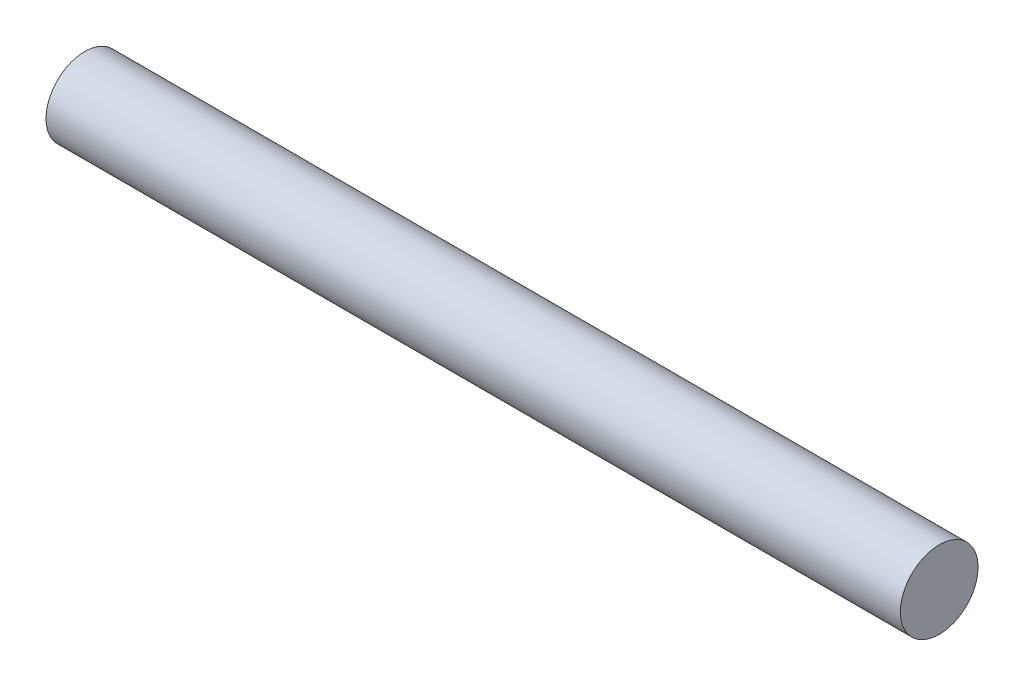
ISO-10303-21;
HEADER;
FILE_DESCRIPTION(('STEP AP214'),'2;1');
FILE_NAME('part.step','',(''),(''),'','','');
FILE_SCHEMA(('AUTOMOTIVE_DESIGN { 1 0 10303 214 1 1 1 1 }'));
ENDSEC;
DATA;
#1=APPLICATION_CONTEXT('core data for automotive mechanical design processes');
#2=APPLICATION_PROTOCOL_DEFINITION('international standard','automotive_design',2000,#1);
#3=PRODUCT_CONTEXT('',#1,'mechanical');
#4=PRODUCT('Part','Part','',(#3));
#5=PRODUCT_RELATED_PRODUCT_CATEGORY('part','',(#4));
#6=PRODUCT_DEFINITION_FORMATION('','',#4);
#7=PRODUCT_DEFINITION_CONTEXT('part definition',#1,'design');
#8=PRODUCT_DEFINITION('design','',#6,#7);
#9=PRODUCT_DEFINITION_SHAPE('','',#8);
#10=(LENGTH_UNIT() NAMED_UNIT(*) SI_UNIT(.MILLI.,.METRE.));
#11=(NAMED_UNIT(*) PLANE_ANGLE_UNIT() SI_UNIT($,.RADIAN.));
#12=(NAMED_UNIT(*) SI_UNIT($,.STERADIAN.) SOLID_ANGLE_UNIT());
#13=UNCERTAINTY_MEASURE_WITH_UNIT(LENGTH_MEASURE(1.E-05),#10,'distance_accuracy_value','');
#14=(GEOMETRIC_REPRESENTATION_CONTEXT(3) GLOBAL_UNCERTAINTY_ASSIGNED_CONTEXT((#13)) GLOBAL_UNIT_ASSIGNED_CONTEXT((#10,
#11,#12)) REPRESENTATION_CONTEXT('',''));
#15=CARTESIAN_POINT('',(0.,0.,0.));
#16=DIRECTION('',(0.,0.,1.));
#17=DIRECTION('',(1.,0.,0.));
#18=AXIS2_PLACEMENT_3D('',#15,#16,#17);
#19=CARTESIAN_POINT('',(-17.,4.,0.));
#20=DIRECTION('',(1.,0.,0.));
#21=DIRECTION('',(0.,0.,-1.));
#22=AXIS2_PLACEMENT_3D('',#19,#20,#21);
#23=PLANE('',#22);
#24=CARTESIAN_POINT('',(-17.,-1.,0.));
#25=DIRECTION('',(-1.,0.,0.));
#26=DIRECTION('',(0.,0.,1.));
#27=AXIS2_PLACEMENT_3D('',#24,#25,#26);
#28=CIRCLE('',#27,5.);
#29=CARTESIAN_POINT('',(-17.,-1.,5.));
#30=VERTEX_POINT('',#29);
#31=EDGE_CURVE('E10',#30,#30,#28,.T.);
#32=ORIENTED_EDGE('',*,*,#31,.T.);
#33=EDGE_LOOP('',(#32));
#34=FACE_BOUND('',#33,.T.);
#35=ADVANCED_FACE('F26',(#34),#23,.F.);
#36=CARTESIAN_POINT('',(-40.,-1.,0.));
#37=DIRECTION('',(-1.,0.,0.));
#38=DIRECTION('',(0.,0.,1.));
#39=AXIS2_PLACEMENT_3D('',#36,#37,#38);
#40=CYLINDRICAL_SURFACE('',#39,4.99999999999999);
#41=ORIENTED_EDGE('',*,*,#31,.F.);
#42=EDGE_LOOP('',(#41));
#43=FACE_BOUND('',#42,.T.);
#44=CARTESIAN_POINT('',(93.,-1.,0.));
#45=DIRECTION('',(-1.,0.,0.));
#46=DIRECTION('',(0.,0.,1.));
#47=AXIS2_PLACEMENT_3D('',#44,#45,#46);
#48=CIRCLE('',#47,4.99999999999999);
#49=CARTESIAN_POINT('',(93.,-1.,4.99999999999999));
#50=VERTEX_POINT('',#49);
#51=EDGE_CURVE('E32',#50,#50,#48,.T.);
#52=ORIENTED_EDGE('',*,*,#51,.T.);
#53=EDGE_LOOP('',(#52));
#54=FACE_BOUND('',#53,.T.);
#55=ADVANCED_FACE('F38',(#43,#54),#40,.T.);
#56=CARTESIAN_POINT('',(93.,3.99999999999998,0.));
#57=DIRECTION('',(-1.,0.,0.));
#58=DIRECTION('',(0.,0.,1.));
#59=AXIS2_PLACEMENT_3D('',#56,#57,#58);
#60=PLANE('',#59);
#61=ORIENTED_EDGE('',*,*,#51,.F.);
#62=EDGE_LOOP('',(#61));
#63=FACE_BOUND('',#62,.T.);
#64=ADVANCED_FACE('F40',(#63),#60,.F.);
#65=CLOSED_SHELL('',(#35,#55,#64));
#66=MANIFOLD_SOLID_BREP('B2',#65);
#67=ADVANCED_BREP_SHAPE_REPRESENTATION('',(#18,#66),#14);
#68=SHAPE_DEFINITION_REPRESENTATION(#9,#67);
ENDSEC;
END-ISO-10303-21;
